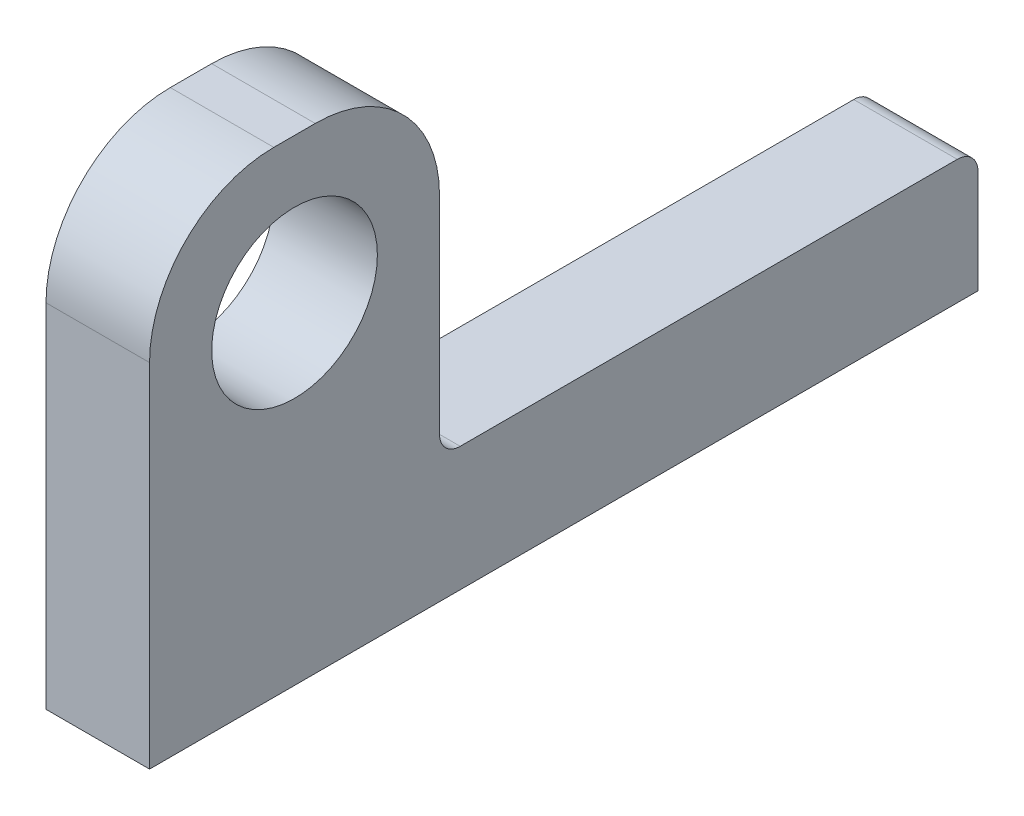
ISO-10303-21;
HEADER;
FILE_DESCRIPTION(('STEP AP214'),'2;1');
FILE_NAME('part.step','',(''),(''),'','','');
FILE_SCHEMA(('AUTOMOTIVE_DESIGN { 1 0 10303 214 1 1 1 1 }'));
ENDSEC;
DATA;
#1=APPLICATION_CONTEXT('core data for automotive mechanical design processes');
#2=APPLICATION_PROTOCOL_DEFINITION('international standard','automotive_design',2000,#1);
#3=PRODUCT_CONTEXT('',#1,'mechanical');
#4=PRODUCT('Part','Part','',(#3));
#5=PRODUCT_RELATED_PRODUCT_CATEGORY('part','',(#4));
#6=PRODUCT_DEFINITION_FORMATION('','',#4);
#7=PRODUCT_DEFINITION_CONTEXT('part definition',#1,'design');
#8=PRODUCT_DEFINITION('design','',#6,#7);
#9=PRODUCT_DEFINITION_SHAPE('','',#8);
#10=(LENGTH_UNIT() NAMED_UNIT(*) SI_UNIT(.MILLI.,.METRE.));
#11=(NAMED_UNIT(*) PLANE_ANGLE_UNIT() SI_UNIT($,.RADIAN.));
#12=(NAMED_UNIT(*) SI_UNIT($,.STERADIAN.) SOLID_ANGLE_UNIT());
#13=UNCERTAINTY_MEASURE_WITH_UNIT(LENGTH_MEASURE(1.E-05),#10,'distance_accuracy_value','');
#14=(GEOMETRIC_REPRESENTATION_CONTEXT(3) GLOBAL_UNCERTAINTY_ASSIGNED_CONTEXT((#13)) GLOBAL_UNIT_ASSIGNED_CONTEXT((#10,
#11,#12)) REPRESENTATION_CONTEXT('',''));
#15=CARTESIAN_POINT('',(0.,0.,0.));
#16=DIRECTION('',(0.,0.,1.));
#17=DIRECTION('',(1.,0.,0.));
#18=AXIS2_PLACEMENT_3D('',#15,#16,#17);
#19=CARTESIAN_POINT('',(5.,17.,-6.));
#20=DIRECTION('',(-1.,0.,0.));
#21=DIRECTION('',(0.,0.,1.));
#22=AXIS2_PLACEMENT_3D('',#19,#20,#21);
#23=PLANE('',#22);
#24=DIRECTION('',(0.,1.,0.));
#25=VECTOR('',#24,1.);
#26=CARTESIAN_POINT('',(5.,0.,-40.));
#27=LINE('',#26,#25);
#28=CARTESIAN_POINT('',(5.,0.,-40.));
#29=VERTEX_POINT('',#28);
#30=CARTESIAN_POINT('',(5.,5.,-40.));
#31=VERTEX_POINT('',#30);
#32=EDGE_CURVE('E118',#29,#31,#27,.T.);
#33=ORIENTED_EDGE('',*,*,#32,.T.);
#34=CARTESIAN_POINT('',(5.,5.,-39.));
#35=DIRECTION('',(-1.,0.,0.));
#36=DIRECTION('',(0.,0.,1.));
#37=AXIS2_PLACEMENT_3D('',#34,#35,#36);
#38=CIRCLE('',#37,1.);
#39=CARTESIAN_POINT('',(5.,6.,-39.));
#40=VERTEX_POINT('',#39);
#41=EDGE_CURVE('E146',#31,#40,#38,.F.);
#42=ORIENTED_EDGE('',*,*,#41,.T.);
#43=DIRECTION('',(0.,0.,1.));
#44=VECTOR('',#43,1.);
#45=CARTESIAN_POINT('',(5.,6.,-14.));
#46=LINE('',#45,#44);
#47=CARTESIAN_POINT('',(5.,6.,-15.));
#48=VERTEX_POINT('',#47);
#49=EDGE_CURVE('E175',#40,#48,#46,.T.);
#50=ORIENTED_EDGE('',*,*,#49,.T.);
#51=CARTESIAN_POINT('',(5.,7.,-15.));
#52=DIRECTION('',(-1.,0.,0.));
#53=DIRECTION('',(0.,0.,1.));
#54=AXIS2_PLACEMENT_3D('',#51,#52,#53);
#55=CIRCLE('',#54,1.);
#56=CARTESIAN_POINT('',(5.,7.,-14.));
#57=VERTEX_POINT('',#56);
#58=EDGE_CURVE('E11',#48,#57,#55,.T.);
#59=ORIENTED_EDGE('',*,*,#58,.T.);
#60=DIRECTION('',(0.,1.,0.));
#61=VECTOR('',#60,1.);
#62=CARTESIAN_POINT('',(5.,6.,-14.));
#63=LINE('',#62,#61);
#64=CARTESIAN_POINT('',(5.,17.,-14.));
#65=VERTEX_POINT('',#64);
#66=EDGE_CURVE('E172',#57,#65,#63,.T.);
#67=ORIENTED_EDGE('',*,*,#66,.T.);
#68=CARTESIAN_POINT('',(5.,17.,-8.));
#69=DIRECTION('',(1.,0.,0.));
#70=DIRECTION('',(0.,0.,-1.));
#71=AXIS2_PLACEMENT_3D('',#68,#69,#70);
#72=CIRCLE('',#71,6.);
#73=CARTESIAN_POINT('',(5.,23.,-8.));
#74=VERTEX_POINT('',#73);
#75=EDGE_CURVE('E174',#65,#74,#72,.T.);
#76=ORIENTED_EDGE('',*,*,#75,.T.);
#77=DIRECTION('',(0.,0.,1.));
#78=VECTOR('',#77,1.);
#79=CARTESIAN_POINT('',(5.,23.,-6.00000000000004));
#80=LINE('',#79,#78);
#81=CARTESIAN_POINT('',(5.,23.,-6.00000000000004));
#82=VERTEX_POINT('',#81);
#83=EDGE_CURVE('E177',#74,#82,#80,.T.);
#84=ORIENTED_EDGE('',*,*,#83,.T.);
#85=CARTESIAN_POINT('',(5.,17.,-6.));
#86=DIRECTION('',(1.,0.,0.));
#87=DIRECTION('',(0.,0.,1.));
#88=AXIS2_PLACEMENT_3D('',#85,#86,#87);
#89=CIRCLE('',#88,6.);
#90=CARTESIAN_POINT('',(5.,17.,0.));
#91=VERTEX_POINT('',#90);
#92=EDGE_CURVE('E124',#82,#91,#89,.T.);
#93=ORIENTED_EDGE('',*,*,#92,.T.);
#94=DIRECTION('',(0.,-1.,0.));
#95=VECTOR('',#94,1.);
#96=CARTESIAN_POINT('',(5.,0.,0.));
#97=LINE('',#96,#95);
#98=CARTESIAN_POINT('',(5.,0.,0.));
#99=VERTEX_POINT('',#98);
#100=EDGE_CURVE('E119',#91,#99,#97,.T.);
#101=ORIENTED_EDGE('',*,*,#100,.T.);
#102=DIRECTION('',(0.,0.,-1.));
#103=VECTOR('',#102,1.);
#104=CARTESIAN_POINT('',(5.,0.,0.));
#105=LINE('',#104,#103);
#106=EDGE_CURVE('E111',#99,#29,#105,.T.);
#107=ORIENTED_EDGE('',*,*,#106,.T.);
#108=EDGE_LOOP('',(#33,#42,#50,#59,#67,#76,#84,#93,#101,#107));
#109=FACE_BOUND('',#108,.T.);
#110=CARTESIAN_POINT('',(5.,16.,-7.));
#111=DIRECTION('',(1.,0.,0.));
#112=DIRECTION('',(0.,0.,-1.));
#113=AXIS2_PLACEMENT_3D('',#110,#111,#112);
#114=CIRCLE('',#113,4.);
#115=CARTESIAN_POINT('',(5.,16.,-11.));
#116=VERTEX_POINT('',#115);
#117=EDGE_CURVE('E187',#116,#116,#114,.T.);
#118=ORIENTED_EDGE('',*,*,#117,.F.);
#119=EDGE_LOOP('',(#118));
#120=FACE_BOUND('',#119,.T.);
#121=ADVANCED_FACE('F33',(#109,#120),#23,.F.);
#122=CARTESIAN_POINT('',(0.,17.,-6.));
#123=DIRECTION('',(-1.,0.,0.));
#124=DIRECTION('',(0.,0.,1.));
#125=AXIS2_PLACEMENT_3D('',#122,#123,#124);
#126=PLANE('',#125);
#127=DIRECTION('',(0.,0.,1.));
#128=VECTOR('',#127,1.);
#129=CARTESIAN_POINT('',(0.,6.,-14.));
#130=LINE('',#129,#128);
#131=CARTESIAN_POINT('',(0.,6.,-39.));
#132=VERTEX_POINT('',#131);
#133=CARTESIAN_POINT('',(0.,6.,-15.));
#134=VERTEX_POINT('',#133);
#135=EDGE_CURVE('E156',#132,#134,#130,.T.);
#136=ORIENTED_EDGE('',*,*,#135,.F.);
#137=CARTESIAN_POINT('',(0.,5.,-39.));
#138=DIRECTION('',(-1.,0.,0.));
#139=DIRECTION('',(0.,0.,1.));
#140=AXIS2_PLACEMENT_3D('',#137,#138,#139);
#141=CIRCLE('',#140,1.);
#142=CARTESIAN_POINT('',(0.,5.,-40.));
#143=VERTEX_POINT('',#142);
#144=EDGE_CURVE('E143',#132,#143,#141,.T.);
#145=ORIENTED_EDGE('',*,*,#144,.T.);
#146=DIRECTION('',(0.,1.,0.));
#147=VECTOR('',#146,1.);
#148=CARTESIAN_POINT('',(0.,0.,-40.));
#149=LINE('',#148,#147);
#150=CARTESIAN_POINT('',(0.,0.,-40.));
#151=VERTEX_POINT('',#150);
#152=EDGE_CURVE('E166',#151,#143,#149,.T.);
#153=ORIENTED_EDGE('',*,*,#152,.F.);
#154=DIRECTION('',(0.,0.,-1.));
#155=VECTOR('',#154,1.);
#156=CARTESIAN_POINT('',(0.,0.,0.));
#157=LINE('',#156,#155);
#158=CARTESIAN_POINT('',(0.,0.,0.));
#159=VERTEX_POINT('',#158);
#160=EDGE_CURVE('E185',#159,#151,#157,.T.);
#161=ORIENTED_EDGE('',*,*,#160,.F.);
#162=DIRECTION('',(0.,-1.,0.));
#163=VECTOR('',#162,1.);
#164=CARTESIAN_POINT('',(0.,6.,0.));
#165=LINE('',#164,#163);
#166=CARTESIAN_POINT('',(0.,17.,0.));
#167=VERTEX_POINT('',#166);
#168=EDGE_CURVE('E128',#167,#159,#165,.T.);
#169=ORIENTED_EDGE('',*,*,#168,.F.);
#170=CARTESIAN_POINT('',(0.,17.,-6.));
#171=DIRECTION('',(1.,0.,0.));
#172=DIRECTION('',(0.,0.,1.));
#173=AXIS2_PLACEMENT_3D('',#170,#171,#172);
#174=CIRCLE('',#173,6.);
#175=CARTESIAN_POINT('',(0.,23.,-6.00000000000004));
#176=VERTEX_POINT('',#175);
#177=EDGE_CURVE('E194',#176,#167,#174,.T.);
#178=ORIENTED_EDGE('',*,*,#177,.F.);
#179=DIRECTION('',(0.,0.,1.));
#180=VECTOR('',#179,1.);
#181=CARTESIAN_POINT('',(0.,23.,-6.00000000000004));
#182=LINE('',#181,#180);
#183=CARTESIAN_POINT('',(0.,23.,-8.));
#184=VERTEX_POINT('',#183);
#185=EDGE_CURVE('E192',#184,#176,#182,.T.);
#186=ORIENTED_EDGE('',*,*,#185,.F.);
#187=CARTESIAN_POINT('',(0.,17.,-8.));
#188=DIRECTION('',(1.,0.,0.));
#189=DIRECTION('',(0.,0.,-1.));
#190=AXIS2_PLACEMENT_3D('',#187,#188,#189);
#191=CIRCLE('',#190,6.);
#192=CARTESIAN_POINT('',(0.,17.,-14.));
#193=VERTEX_POINT('',#192);
#194=EDGE_CURVE('E190',#193,#184,#191,.T.);
#195=ORIENTED_EDGE('',*,*,#194,.F.);
#196=DIRECTION('',(0.,1.,0.));
#197=VECTOR('',#196,1.);
#198=CARTESIAN_POINT('',(0.,6.,-14.));
#199=LINE('',#198,#197);
#200=CARTESIAN_POINT('',(0.,7.,-14.));
#201=VERTEX_POINT('',#200);
#202=EDGE_CURVE('E158',#201,#193,#199,.T.);
#203=ORIENTED_EDGE('',*,*,#202,.F.);
#204=CARTESIAN_POINT('',(0.,7.,-15.));
#205=DIRECTION('',(-1.,0.,0.));
#206=DIRECTION('',(0.,0.,1.));
#207=AXIS2_PLACEMENT_3D('',#204,#205,#206);
#208=CIRCLE('',#207,1.);
#209=EDGE_CURVE('E41',#201,#134,#208,.F.);
#210=ORIENTED_EDGE('',*,*,#209,.T.);
#211=EDGE_LOOP('',(#136,#145,#153,#161,#169,#178,#186,#195,#203,#210));
#212=FACE_BOUND('',#211,.T.);
#213=CARTESIAN_POINT('',(0.,16.,-7.));
#214=DIRECTION('',(1.,0.,0.));
#215=DIRECTION('',(0.,0.,-1.));
#216=AXIS2_PLACEMENT_3D('',#213,#214,#215);
#217=CIRCLE('',#216,4.);
#218=CARTESIAN_POINT('',(0.,16.,-11.));
#219=VERTEX_POINT('',#218);
#220=EDGE_CURVE('E218',#219,#219,#217,.T.);
#221=ORIENTED_EDGE('',*,*,#220,.T.);
#222=EDGE_LOOP('',(#221));
#223=FACE_BOUND('',#222,.T.);
#224=ADVANCED_FACE('F154',(#212,#223),#126,.T.);
#225=CARTESIAN_POINT('',(5.,0.,0.));
#226=DIRECTION('',(0.,1.,0.));
#227=DIRECTION('',(0.,0.,1.));
#228=AXIS2_PLACEMENT_3D('',#225,#226,#227);
#229=PLANE('',#228);
#230=ORIENTED_EDGE('',*,*,#160,.T.);
#231=DIRECTION('',(-1.,0.,0.));
#232=VECTOR('',#231,1.);
#233=CARTESIAN_POINT('',(5.,0.,-40.));
#234=LINE('',#233,#232);
#235=EDGE_CURVE('E117',#29,#151,#234,.T.);
#236=ORIENTED_EDGE('',*,*,#235,.F.);
#237=ORIENTED_EDGE('',*,*,#106,.F.);
#238=DIRECTION('',(-1.,0.,0.));
#239=VECTOR('',#238,1.);
#240=CARTESIAN_POINT('',(5.,0.,0.));
#241=LINE('',#240,#239);
#242=EDGE_CURVE('E115',#99,#159,#241,.T.);
#243=ORIENTED_EDGE('',*,*,#242,.T.);
#244=EDGE_LOOP('',(#230,#236,#237,#243));
#245=FACE_BOUND('',#244,.T.);
#246=ADVANCED_FACE('F113',(#245),#229,.F.);
#247=CARTESIAN_POINT('',(5.,0.,-40.));
#248=DIRECTION('',(0.,0.,1.));
#249=DIRECTION('',(1.,0.,0.));
#250=AXIS2_PLACEMENT_3D('',#247,#248,#249);
#251=PLANE('',#250);
#252=ORIENTED_EDGE('',*,*,#152,.T.);
#253=DIRECTION('',(-1.,0.,0.));
#254=VECTOR('',#253,1.);
#255=CARTESIAN_POINT('',(5.,5.,-40.));
#256=LINE('',#255,#254);
#257=EDGE_CURVE('E54',#143,#31,#256,.F.);
#258=ORIENTED_EDGE('',*,*,#257,.T.);
#259=ORIENTED_EDGE('',*,*,#32,.F.);
#260=ORIENTED_EDGE('',*,*,#235,.T.);
#261=EDGE_LOOP('',(#252,#258,#259,#260));
#262=FACE_BOUND('',#261,.T.);
#263=ADVANCED_FACE('F215',(#262),#251,.F.);
#264=CARTESIAN_POINT('',(5.,6.,-14.));
#265=DIRECTION('',(0.,-1.,0.));
#266=DIRECTION('',(0.,0.,-1.));
#267=AXIS2_PLACEMENT_3D('',#264,#265,#266);
#268=PLANE('',#267);
#269=ORIENTED_EDGE('',*,*,#49,.F.);
#270=DIRECTION('',(-1.,0.,0.));
#271=VECTOR('',#270,1.);
#272=CARTESIAN_POINT('',(5.,6.,-39.));
#273=LINE('',#272,#271);
#274=EDGE_CURVE('E135',#40,#132,#273,.T.);
#275=ORIENTED_EDGE('',*,*,#274,.T.);
#276=ORIENTED_EDGE('',*,*,#135,.T.);
#277=DIRECTION('',(-1.,0.,0.));
#278=VECTOR('',#277,1.);
#279=CARTESIAN_POINT('',(5.,6.,-15.));
#280=LINE('',#279,#278);
#281=EDGE_CURVE('E133',#134,#48,#280,.F.);
#282=ORIENTED_EDGE('',*,*,#281,.T.);
#283=EDGE_LOOP('',(#269,#275,#276,#282));
#284=FACE_BOUND('',#283,.T.);
#285=ADVANCED_FACE('F164',(#284),#268,.F.);
#286=CARTESIAN_POINT('',(5.,6.,-14.));
#287=DIRECTION('',(0.,0.,1.));
#288=DIRECTION('',(0.,-1.,0.));
#289=AXIS2_PLACEMENT_3D('',#286,#287,#288);
#290=PLANE('',#289);
#291=ORIENTED_EDGE('',*,*,#66,.F.);
#292=DIRECTION('',(-1.,0.,0.));
#293=VECTOR('',#292,1.);
#294=CARTESIAN_POINT('',(0.,7.,-14.));
#295=LINE('',#294,#293);
#296=EDGE_CURVE('E148',#57,#201,#295,.T.);
#297=ORIENTED_EDGE('',*,*,#296,.T.);
#298=ORIENTED_EDGE('',*,*,#202,.T.);
#299=DIRECTION('',(-1.,0.,0.));
#300=VECTOR('',#299,1.);
#301=CARTESIAN_POINT('',(5.,17.,-14.));
#302=LINE('',#301,#300);
#303=EDGE_CURVE('E137',#65,#193,#302,.T.);
#304=ORIENTED_EDGE('',*,*,#303,.F.);
#305=EDGE_LOOP('',(#291,#297,#298,#304));
#306=FACE_BOUND('',#305,.T.);
#307=ADVANCED_FACE('F169',(#306),#290,.F.);
#308=CARTESIAN_POINT('',(5.,17.,-8.));
#309=DIRECTION('',(-1.,0.,0.));
#310=DIRECTION('',(0.,0.,1.));
#311=AXIS2_PLACEMENT_3D('',#308,#309,#310);
#312=CYLINDRICAL_SURFACE('',#311,6.);
#313=ORIENTED_EDGE('',*,*,#194,.T.);
#314=DIRECTION('',(-1.,0.,0.));
#315=VECTOR('',#314,1.);
#316=CARTESIAN_POINT('',(5.,23.,-8.));
#317=LINE('',#316,#315);
#318=EDGE_CURVE('E201',#74,#184,#317,.T.);
#319=ORIENTED_EDGE('',*,*,#318,.F.);
#320=ORIENTED_EDGE('',*,*,#75,.F.);
#321=ORIENTED_EDGE('',*,*,#303,.T.);
#322=EDGE_LOOP('',(#313,#319,#320,#321));
#323=FACE_BOUND('',#322,.T.);
#324=ADVANCED_FACE('F204',(#323),#312,.T.);
#325=CARTESIAN_POINT('',(5.,23.,-6.00000000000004));
#326=DIRECTION('',(0.,-1.,0.));
#327=DIRECTION('',(0.,0.,-1.));
#328=AXIS2_PLACEMENT_3D('',#325,#326,#327);
#329=PLANE('',#328);
#330=ORIENTED_EDGE('',*,*,#185,.T.);
#331=DIRECTION('',(-1.,0.,0.));
#332=VECTOR('',#331,1.);
#333=CARTESIAN_POINT('',(5.,23.,-6.00000000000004));
#334=LINE('',#333,#332);
#335=EDGE_CURVE('E198',#82,#176,#334,.T.);
#336=ORIENTED_EDGE('',*,*,#335,.F.);
#337=ORIENTED_EDGE('',*,*,#83,.F.);
#338=ORIENTED_EDGE('',*,*,#318,.T.);
#339=EDGE_LOOP('',(#330,#336,#337,#338));
#340=FACE_BOUND('',#339,.T.);
#341=ADVANCED_FACE('F210',(#340),#329,.F.);
#342=CARTESIAN_POINT('',(5.,17.,-6.));
#343=DIRECTION('',(-1.,0.,0.));
#344=DIRECTION('',(0.,0.,1.));
#345=AXIS2_PLACEMENT_3D('',#342,#343,#344);
#346=CYLINDRICAL_SURFACE('',#345,6.);
#347=ORIENTED_EDGE('',*,*,#177,.T.);
#348=DIRECTION('',(-1.,0.,0.));
#349=VECTOR('',#348,1.);
#350=CARTESIAN_POINT('',(5.,17.,0.));
#351=LINE('',#350,#349);
#352=EDGE_CURVE('E184',#91,#167,#351,.T.);
#353=ORIENTED_EDGE('',*,*,#352,.F.);
#354=ORIENTED_EDGE('',*,*,#92,.F.);
#355=ORIENTED_EDGE('',*,*,#335,.T.);
#356=EDGE_LOOP('',(#347,#353,#354,#355));
#357=FACE_BOUND('',#356,.T.);
#358=ADVANCED_FACE('F213',(#357),#346,.T.);
#359=CARTESIAN_POINT('',(5.,6.,0.));
#360=DIRECTION('',(0.,0.,-1.));
#361=DIRECTION('',(-1.,0.,0.));
#362=AXIS2_PLACEMENT_3D('',#359,#360,#361);
#363=PLANE('',#362);
#364=ORIENTED_EDGE('',*,*,#168,.T.);
#365=ORIENTED_EDGE('',*,*,#242,.F.);
#366=ORIENTED_EDGE('',*,*,#100,.F.);
#367=ORIENTED_EDGE('',*,*,#352,.T.);
#368=EDGE_LOOP('',(#364,#365,#366,#367));
#369=FACE_BOUND('',#368,.T.);
#370=ADVANCED_FACE('F130',(#369),#363,.F.);
#371=CARTESIAN_POINT('',(5.,16.,-7.));
#372=DIRECTION('',(-1.,0.,0.));
#373=DIRECTION('',(0.,0.,1.));
#374=AXIS2_PLACEMENT_3D('',#371,#372,#373);
#375=CYLINDRICAL_SURFACE('',#374,4.);
#376=ORIENTED_EDGE('',*,*,#117,.T.);
#377=EDGE_LOOP('',(#376));
#378=FACE_BOUND('',#377,.T.);
#379=ORIENTED_EDGE('',*,*,#220,.F.);
#380=EDGE_LOOP('',(#379));
#381=FACE_BOUND('',#380,.T.);
#382=ADVANCED_FACE('F224',(#378,#381),#375,.F.);
#383=CARTESIAN_POINT('',(5.,5.,-39.));
#384=DIRECTION('',(-1.,0.,0.));
#385=DIRECTION('',(0.,0.,1.));
#386=AXIS2_PLACEMENT_3D('',#383,#384,#385);
#387=CYLINDRICAL_SURFACE('',#386,1.);
#388=ORIENTED_EDGE('',*,*,#41,.F.);
#389=ORIENTED_EDGE('',*,*,#257,.F.);
#390=ORIENTED_EDGE('',*,*,#144,.F.);
#391=ORIENTED_EDGE('',*,*,#274,.F.);
#392=EDGE_LOOP('',(#388,#389,#390,#391));
#393=FACE_BOUND('',#392,.T.);
#394=ADVANCED_FACE('F249',(#393),#387,.T.);
#395=CARTESIAN_POINT('',(5.,7.,-15.));
#396=DIRECTION('',(1.,0.,0.));
#397=DIRECTION('',(0.,0.,-1.));
#398=AXIS2_PLACEMENT_3D('',#395,#396,#397);
#399=CYLINDRICAL_SURFACE('',#398,1.);
#400=ORIENTED_EDGE('',*,*,#58,.F.);
#401=ORIENTED_EDGE('',*,*,#281,.F.);
#402=ORIENTED_EDGE('',*,*,#209,.F.);
#403=ORIENTED_EDGE('',*,*,#296,.F.);
#404=EDGE_LOOP('',(#400,#401,#402,#403));
#405=FACE_BOUND('',#404,.T.);
#406=ADVANCED_FACE('F35',(#405),#399,.F.);
#407=CLOSED_SHELL('',(#121,#224,#246,#263,#285,#307,#324,#341,#358,#370,#382,#394,#406));
#408=MANIFOLD_SOLID_BREP('B2',#407);
#409=ADVANCED_BREP_SHAPE_REPRESENTATION('',(#18,#408),#14);
#410=SHAPE_DEFINITION_REPRESENTATION(#9,#409);
ENDSEC;
END-ISO-10303-21;
